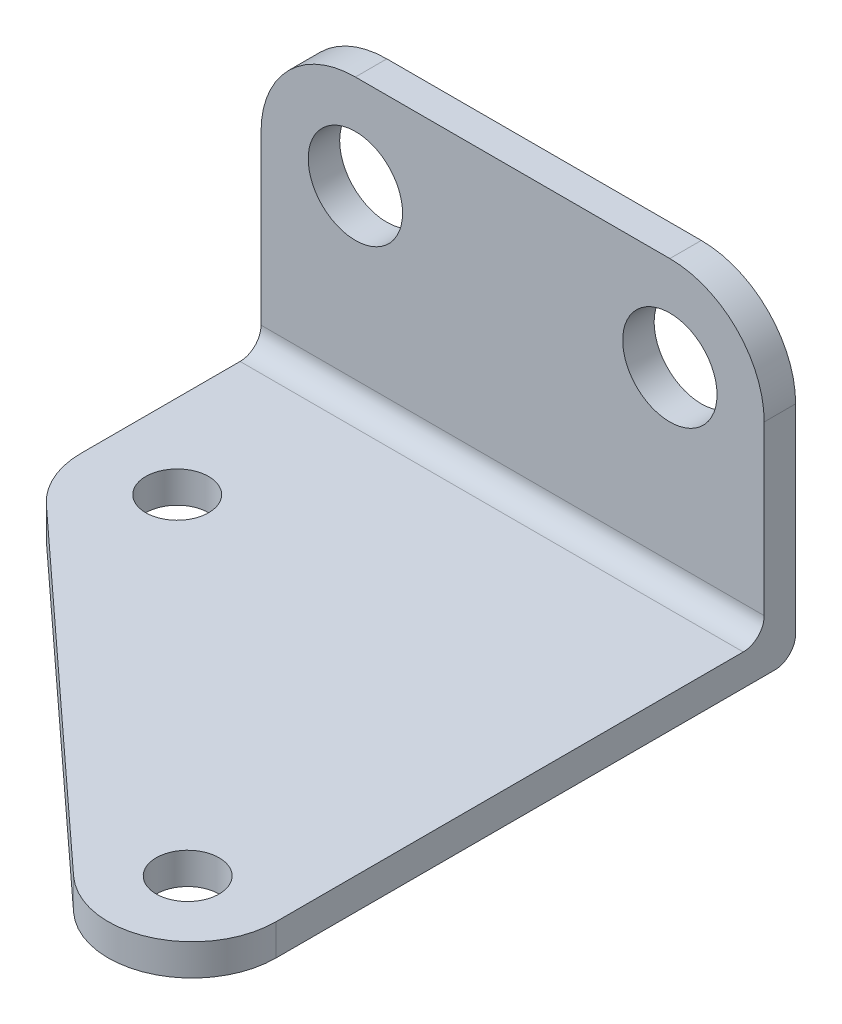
ISO-10303-21;
HEADER;
FILE_DESCRIPTION(('STEP AP214'),'2;1');
FILE_NAME('part.step','',(''),(''),'','','');
FILE_SCHEMA(('AUTOMOTIVE_DESIGN { 1 0 10303 214 1 1 1 1 }'));
ENDSEC;
DATA;
#1=APPLICATION_CONTEXT('core data for automotive mechanical design processes');
#2=APPLICATION_PROTOCOL_DEFINITION('international standard','automotive_design',2000,#1);
#3=PRODUCT_CONTEXT('',#1,'mechanical');
#4=PRODUCT('Part','Part','',(#3));
#5=PRODUCT_RELATED_PRODUCT_CATEGORY('part','',(#4));
#6=PRODUCT_DEFINITION_FORMATION('','',#4);
#7=PRODUCT_DEFINITION_CONTEXT('part definition',#1,'design');
#8=PRODUCT_DEFINITION('design','',#6,#7);
#9=PRODUCT_DEFINITION_SHAPE('','',#8);
#10=(LENGTH_UNIT() NAMED_UNIT(*) SI_UNIT(.MILLI.,.METRE.));
#11=(NAMED_UNIT(*) PLANE_ANGLE_UNIT() SI_UNIT($,.RADIAN.));
#12=(NAMED_UNIT(*) SI_UNIT($,.STERADIAN.) SOLID_ANGLE_UNIT());
#13=UNCERTAINTY_MEASURE_WITH_UNIT(LENGTH_MEASURE(1.E-05),#10,'distance_accuracy_value','');
#14=(GEOMETRIC_REPRESENTATION_CONTEXT(3) GLOBAL_UNCERTAINTY_ASSIGNED_CONTEXT((#13)) GLOBAL_UNIT_ASSIGNED_CONTEXT((#10,
#11,#12)) REPRESENTATION_CONTEXT('',''));
#15=CARTESIAN_POINT('',(0.,0.,0.));
#16=DIRECTION('',(0.,0.,1.));
#17=DIRECTION('',(1.,0.,0.));
#18=AXIS2_PLACEMENT_3D('',#15,#16,#17);
#19=CARTESIAN_POINT('',(0.,6.,0.));
#20=DIRECTION('',(0.,-1.,0.));
#21=DIRECTION('',(-1.,0.,0.));
#22=AXIS2_PLACEMENT_3D('',#19,#20,#21);
#23=PLANE('',#22);
#24=CARTESIAN_POINT('',(-40.,5.99999999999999,19.));
#25=DIRECTION('',(0.,1.,0.));
#26=DIRECTION('',(-1.,0.,0.));
#27=AXIS2_PLACEMENT_3D('',#24,#25,#26);
#28=CIRCLE('',#27,3.);
#29=CARTESIAN_POINT('',(-43.,5.99999999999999,19.));
#30=VERTEX_POINT('',#29);
#31=EDGE_CURVE('E219',#30,#30,#28,.T.);
#32=ORIENTED_EDGE('',*,*,#31,.F.);
#33=EDGE_LOOP('',(#32));
#34=FACE_BOUND('',#33,.T.);
#35=CARTESIAN_POINT('',(-8.,6.,50.));
#36=DIRECTION('',(0.,1.,0.));
#37=DIRECTION('',(-1.,0.,0.));
#38=AXIS2_PLACEMENT_3D('',#35,#36,#37);
#39=CIRCLE('',#38,3.);
#40=CARTESIAN_POINT('',(-11.,6.,50.));
#41=VERTEX_POINT('',#40);
#42=EDGE_CURVE('E210',#41,#41,#39,.T.);
#43=ORIENTED_EDGE('',*,*,#42,.F.);
#44=EDGE_LOOP('',(#43));
#45=FACE_BOUND('',#44,.T.);
#46=DIRECTION('',(0.,0.,-1.));
#47=VECTOR('',#46,1.);
#48=CARTESIAN_POINT('',(0.,6.,0.));
#49=LINE('',#48,#47);
#50=CARTESIAN_POINT('',(0.,6.,49.5770311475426));
#51=VERTEX_POINT('',#50);
#52=CARTESIAN_POINT('',(0.,6.,5.));
#53=VERTEX_POINT('',#52);
#54=EDGE_CURVE('E222',#51,#53,#49,.T.);
#55=ORIENTED_EDGE('',*,*,#54,.T.);
#56=DIRECTION('',(1.,0.,0.));
#57=VECTOR('',#56,1.);
#58=CARTESIAN_POINT('',(-48.,5.99999999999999,5.00000000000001));
#59=LINE('',#58,#57);
#60=CARTESIAN_POINT('',(-48.,5.99999999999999,5.00000000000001));
#61=VERTEX_POINT('',#60);
#62=EDGE_CURVE('E54',#53,#61,#59,.F.);
#63=ORIENTED_EDGE('',*,*,#62,.T.);
#64=DIRECTION('',(0.,0.,1.));
#65=VECTOR('',#64,1.);
#66=CARTESIAN_POINT('',(-48.,5.99999999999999,0.));
#67=LINE('',#66,#65);
#68=CARTESIAN_POINT('',(-48.,5.99999999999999,20.1779621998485));
#69=VERTEX_POINT('',#68);
#70=EDGE_CURVE('E223',#61,#69,#67,.T.);
#71=ORIENTED_EDGE('',*,*,#70,.T.);
#72=CARTESIAN_POINT('',(-40.,5.99999999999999,20.1779621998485));
#73=DIRECTION('',(0.,-1.,0.));
#74=DIRECTION('',(1.,0.,0.));
#75=AXIS2_PLACEMENT_3D('',#72,#73,#74);
#76=CIRCLE('',#75,8.);
#77=CARTESIAN_POINT('',(-45.4123698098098,5.99999999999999,26.0691635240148));
#78=VERTEX_POINT('',#77);
#79=EDGE_CURVE('E178',#69,#78,#76,.F.);
#80=ORIENTED_EDGE('',*,*,#79,.T.);
#81=DIRECTION('',(0.736400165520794,0.,0.676546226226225));
#82=VECTOR('',#81,1.);
#83=CARTESIAN_POINT('',(-48.,5.99999999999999,23.6918535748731));
#84=LINE('',#83,#82);
#85=CARTESIAN_POINT('',(-13.4123698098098,6.,55.468232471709));
#86=VERTEX_POINT('',#85);
#87=EDGE_CURVE('E228',#78,#86,#84,.T.);
#88=ORIENTED_EDGE('',*,*,#87,.T.);
#89=CARTESIAN_POINT('',(-8.,6.,49.5770311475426));
#90=DIRECTION('',(0.,-1.,0.));
#91=DIRECTION('',(1.,0.,0.));
#92=AXIS2_PLACEMENT_3D('',#89,#90,#91);
#93=CIRCLE('',#92,8.);
#94=EDGE_CURVE('E148',#86,#51,#93,.F.);
#95=ORIENTED_EDGE('',*,*,#94,.T.);
#96=EDGE_LOOP('',(#55,#63,#71,#80,#88,#95));
#97=FACE_BOUND('',#96,.T.);
#98=ADVANCED_FACE('F33',(#34,#45,#97),#23,.F.);
#99=CARTESIAN_POINT('',(0.,0.,3.));
#100=DIRECTION('',(-1.,0.,0.));
#101=DIRECTION('',(0.,-1.,0.));
#102=AXIS2_PLACEMENT_3D('',#99,#100,#101);
#103=PLANE('',#102);
#104=DIRECTION('',(0.,0.,-1.));
#105=VECTOR('',#104,1.);
#106=CARTESIAN_POINT('',(0.,3.,0.));
#107=LINE('',#106,#105);
#108=CARTESIAN_POINT('',(0.,3.,49.5770311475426));
#109=VERTEX_POINT('',#108);
#110=CARTESIAN_POINT('',(0.,3.,2.));
#111=VERTEX_POINT('',#110);
#112=EDGE_CURVE('E133',#109,#111,#107,.T.);
#113=ORIENTED_EDGE('',*,*,#112,.T.);
#114=CARTESIAN_POINT('',(0.,5.,2.));
#115=DIRECTION('',(-1.,0.,0.));
#116=DIRECTION('',(0.,-1.,0.));
#117=AXIS2_PLACEMENT_3D('',#114,#115,#116);
#118=CIRCLE('',#117,2.);
#119=CARTESIAN_POINT('',(0.,5.,0.));
#120=VERTEX_POINT('',#119);
#121=EDGE_CURVE('E190',#111,#120,#118,.F.);
#122=ORIENTED_EDGE('',*,*,#121,.T.);
#123=DIRECTION('',(0.,1.,0.));
#124=VECTOR('',#123,1.);
#125=CARTESIAN_POINT('',(0.,3.,0.));
#126=LINE('',#125,#124);
#127=CARTESIAN_POINT('',(0.,24.,0.));
#128=VERTEX_POINT('',#127);
#129=EDGE_CURVE('E144',#120,#128,#126,.T.);
#130=ORIENTED_EDGE('',*,*,#129,.T.);
#131=DIRECTION('',(0.,0.,-1.));
#132=VECTOR('',#131,1.);
#133=CARTESIAN_POINT('',(0.,24.,3.));
#134=LINE('',#133,#132);
#135=CARTESIAN_POINT('',(0.,24.,3.));
#136=VERTEX_POINT('',#135);
#137=EDGE_CURVE('E166',#128,#136,#134,.F.);
#138=ORIENTED_EDGE('',*,*,#137,.T.);
#139=DIRECTION('',(0.,-1.,0.));
#140=VECTOR('',#139,1.);
#141=CARTESIAN_POINT('',(0.,33.,3.));
#142=LINE('',#141,#140);
#143=CARTESIAN_POINT('',(0.,8.,3.));
#144=VERTEX_POINT('',#143);
#145=EDGE_CURVE('E200',#136,#144,#142,.T.);
#146=ORIENTED_EDGE('',*,*,#145,.T.);
#147=CARTESIAN_POINT('',(0.,8.,5.));
#148=DIRECTION('',(-1.,0.,0.));
#149=DIRECTION('',(0.,-1.,0.));
#150=AXIS2_PLACEMENT_3D('',#147,#148,#149);
#151=CIRCLE('',#150,2.);
#152=EDGE_CURVE('E41',#144,#53,#151,.T.);
#153=ORIENTED_EDGE('',*,*,#152,.T.);
#154=ORIENTED_EDGE('',*,*,#54,.F.);
#155=DIRECTION('',(0.,1.,0.));
#156=VECTOR('',#155,1.);
#157=CARTESIAN_POINT('',(0.,0.,49.5770311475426));
#158=LINE('',#157,#156);
#159=EDGE_CURVE('E150',#51,#109,#158,.F.);
#160=ORIENTED_EDGE('',*,*,#159,.T.);
#161=EDGE_LOOP('',(#113,#122,#130,#138,#146,#153,#154,#160));
#162=FACE_BOUND('',#161,.T.);
#163=ADVANCED_FACE('F206',(#162),#103,.F.);
#164=CARTESIAN_POINT('',(-48.,0.,3.));
#165=DIRECTION('',(1.,0.,0.));
#166=DIRECTION('',(0.,0.,-1.));
#167=AXIS2_PLACEMENT_3D('',#164,#165,#166);
#168=PLANE('',#167);
#169=DIRECTION('',(0.,1.,0.));
#170=VECTOR('',#169,1.);
#171=CARTESIAN_POINT('',(-48.,2.99999999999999,0.));
#172=LINE('',#171,#170);
#173=CARTESIAN_POINT('',(-48.,4.99999999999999,0.));
#174=VERTEX_POINT('',#173);
#175=CARTESIAN_POINT('',(-48.,24.,0.));
#176=VERTEX_POINT('',#175);
#177=EDGE_CURVE('E226',#174,#176,#172,.T.);
#178=ORIENTED_EDGE('',*,*,#177,.F.);
#179=CARTESIAN_POINT('',(-48.,4.99999999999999,2.00000000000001));
#180=DIRECTION('',(1.,0.,0.));
#181=DIRECTION('',(0.,0.,-1.));
#182=AXIS2_PLACEMENT_3D('',#179,#180,#181);
#183=CIRCLE('',#182,2.);
#184=CARTESIAN_POINT('',(-48.,2.99999999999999,2.00000000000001));
#185=VERTEX_POINT('',#184);
#186=EDGE_CURVE('E186',#174,#185,#183,.F.);
#187=ORIENTED_EDGE('',*,*,#186,.T.);
#188=DIRECTION('',(0.,0.,1.));
#189=VECTOR('',#188,1.);
#190=CARTESIAN_POINT('',(-48.,2.99999999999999,0.));
#191=LINE('',#190,#189);
#192=CARTESIAN_POINT('',(-48.,2.99999999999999,20.1779621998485));
#193=VERTEX_POINT('',#192);
#194=EDGE_CURVE('E132',#185,#193,#191,.T.);
#195=ORIENTED_EDGE('',*,*,#194,.T.);
#196=DIRECTION('',(0.,1.,0.));
#197=VECTOR('',#196,1.);
#198=CARTESIAN_POINT('',(-48.,0.,20.1779621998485));
#199=LINE('',#198,#197);
#200=EDGE_CURVE('E175',#193,#69,#199,.T.);
#201=ORIENTED_EDGE('',*,*,#200,.T.);
#202=ORIENTED_EDGE('',*,*,#70,.F.);
#203=CARTESIAN_POINT('',(-48.,7.99999999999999,5.00000000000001));
#204=DIRECTION('',(1.,0.,0.));
#205=DIRECTION('',(0.,0.,-1.));
#206=AXIS2_PLACEMENT_3D('',#203,#204,#205);
#207=CIRCLE('',#206,2.);
#208=CARTESIAN_POINT('',(-48.,7.99999999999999,3.00000000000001));
#209=VERTEX_POINT('',#208);
#210=EDGE_CURVE('E11',#61,#209,#207,.T.);
#211=ORIENTED_EDGE('',*,*,#210,.T.);
#212=DIRECTION('',(0.,-1.,0.));
#213=VECTOR('',#212,1.);
#214=CARTESIAN_POINT('',(-48.,33.,3.00000000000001));
#215=LINE('',#214,#213);
#216=CARTESIAN_POINT('',(-48.,24.,3.00000000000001));
#217=VERTEX_POINT('',#216);
#218=EDGE_CURVE('E203',#217,#209,#215,.T.);
#219=ORIENTED_EDGE('',*,*,#218,.F.);
#220=DIRECTION('',(0.,0.,1.));
#221=VECTOR('',#220,1.);
#222=CARTESIAN_POINT('',(-48.,24.,3.));
#223=LINE('',#222,#221);
#224=EDGE_CURVE('E172',#217,#176,#223,.F.);
#225=ORIENTED_EDGE('',*,*,#224,.T.);
#226=EDGE_LOOP('',(#178,#187,#195,#201,#202,#211,#219,#225));
#227=FACE_BOUND('',#226,.T.);
#228=ADVANCED_FACE('F251',(#227),#168,.F.);
#229=CARTESIAN_POINT('',(-48.,2.99999999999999,23.6918535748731));
#230=DIRECTION('',(0.676546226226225,0.,-0.736400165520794));
#231=DIRECTION('',(-0.736400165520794,0.,-0.676546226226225));
#232=AXIS2_PLACEMENT_3D('',#229,#230,#231);
#233=PLANE('',#232);
#234=ORIENTED_EDGE('',*,*,#87,.F.);
#235=DIRECTION('',(0.,1.,0.));
#236=VECTOR('',#235,1.);
#237=CARTESIAN_POINT('',(-45.4123698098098,2.99999999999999,26.0691635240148));
#238=LINE('',#237,#236);
#239=CARTESIAN_POINT('',(-45.4123698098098,2.99999999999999,26.0691635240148));
#240=VERTEX_POINT('',#239);
#241=EDGE_CURVE('E128',#78,#240,#238,.F.);
#242=ORIENTED_EDGE('',*,*,#241,.T.);
#243=DIRECTION('',(0.736400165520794,0.,0.676546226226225));
#244=VECTOR('',#243,1.);
#245=CARTESIAN_POINT('',(-48.,2.99999999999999,23.6918535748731));
#246=LINE('',#245,#244);
#247=CARTESIAN_POINT('',(-13.4123698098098,3.,55.468232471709));
#248=VERTEX_POINT('',#247);
#249=EDGE_CURVE('E121',#240,#248,#246,.T.);
#250=ORIENTED_EDGE('',*,*,#249,.T.);
#251=DIRECTION('',(0.,1.,0.));
#252=VECTOR('',#251,1.);
#253=CARTESIAN_POINT('',(-13.4123698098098,3.,55.468232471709));
#254=LINE('',#253,#252);
#255=EDGE_CURVE('E126',#248,#86,#254,.T.);
#256=ORIENTED_EDGE('',*,*,#255,.T.);
#257=EDGE_LOOP('',(#234,#242,#250,#256));
#258=FACE_BOUND('',#257,.T.);
#259=ADVANCED_FACE('F124',(#258),#233,.F.);
#260=CARTESIAN_POINT('',(-40.,3.,19.));
#261=DIRECTION('',(0.,-1.,0.));
#262=DIRECTION('',(1.,0.,0.));
#263=AXIS2_PLACEMENT_3D('',#260,#261,#262);
#264=CYLINDRICAL_SURFACE('',#263,3.);
#265=CARTESIAN_POINT('',(-40.,3.,19.));
#266=DIRECTION('',(0.,1.,0.));
#267=DIRECTION('',(-1.,0.,0.));
#268=AXIS2_PLACEMENT_3D('',#265,#266,#267);
#269=CIRCLE('',#268,3.);
#270=CARTESIAN_POINT('',(-43.,2.99999999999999,19.));
#271=VERTEX_POINT('',#270);
#272=EDGE_CURVE('E466',#271,#271,#269,.T.);
#273=ORIENTED_EDGE('',*,*,#272,.F.);
#274=EDGE_LOOP('',(#273));
#275=FACE_BOUND('',#274,.T.);
#276=ORIENTED_EDGE('',*,*,#31,.T.);
#277=EDGE_LOOP('',(#276));
#278=FACE_BOUND('',#277,.T.);
#279=ADVANCED_FACE('F282',(#275,#278),#264,.F.);
#280=CARTESIAN_POINT('',(-8.,3.,50.));
#281=DIRECTION('',(0.,-1.,0.));
#282=DIRECTION('',(1.,0.,0.));
#283=AXIS2_PLACEMENT_3D('',#280,#281,#282);
#284=CYLINDRICAL_SURFACE('',#283,3.);
#285=CARTESIAN_POINT('',(-8.,3.,50.));
#286=DIRECTION('',(0.,1.,0.));
#287=DIRECTION('',(-1.,0.,0.));
#288=AXIS2_PLACEMENT_3D('',#285,#286,#287);
#289=CIRCLE('',#288,3.);
#290=CARTESIAN_POINT('',(-11.,3.,50.));
#291=VERTEX_POINT('',#290);
#292=EDGE_CURVE('E463',#291,#291,#289,.T.);
#293=ORIENTED_EDGE('',*,*,#292,.F.);
#294=EDGE_LOOP('',(#293));
#295=FACE_BOUND('',#294,.T.);
#296=ORIENTED_EDGE('',*,*,#42,.T.);
#297=EDGE_LOOP('',(#296));
#298=FACE_BOUND('',#297,.T.);
#299=ADVANCED_FACE('F279',(#295,#298),#284,.F.);
#300=CARTESIAN_POINT('',(0.,3.,0.));
#301=DIRECTION('',(0.,-1.,0.));
#302=DIRECTION('',(-1.,0.,0.));
#303=AXIS2_PLACEMENT_3D('',#300,#301,#302);
#304=PLANE('',#303);
#305=ORIENTED_EDGE('',*,*,#194,.F.);
#306=DIRECTION('',(-1.,0.,0.));
#307=VECTOR('',#306,1.);
#308=CARTESIAN_POINT('',(0.,3.,2.));
#309=LINE('',#308,#307);
#310=EDGE_CURVE('E188',#185,#111,#309,.F.);
#311=ORIENTED_EDGE('',*,*,#310,.T.);
#312=ORIENTED_EDGE('',*,*,#112,.F.);
#313=CARTESIAN_POINT('',(-8.,3.,49.5770311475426));
#314=DIRECTION('',(0.,1.,0.));
#315=DIRECTION('',(-1.,0.,0.));
#316=AXIS2_PLACEMENT_3D('',#313,#314,#315);
#317=CIRCLE('',#316,8.);
#318=EDGE_CURVE('E136',#248,#109,#317,.T.);
#319=ORIENTED_EDGE('',*,*,#318,.F.);
#320=ORIENTED_EDGE('',*,*,#249,.F.);
#321=CARTESIAN_POINT('',(-40.,3.,20.1779621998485));
#322=DIRECTION('',(0.,-1.,0.));
#323=DIRECTION('',(1.,0.,0.));
#324=AXIS2_PLACEMENT_3D('',#321,#322,#323);
#325=CIRCLE('',#324,8.);
#326=EDGE_CURVE('E181',#240,#193,#325,.T.);
#327=ORIENTED_EDGE('',*,*,#326,.T.);
#328=EDGE_LOOP('',(#305,#311,#312,#319,#320,#327));
#329=FACE_BOUND('',#328,.T.);
#330=ORIENTED_EDGE('',*,*,#272,.T.);
#331=EDGE_LOOP('',(#330));
#332=FACE_BOUND('',#331,.T.);
#333=ORIENTED_EDGE('',*,*,#292,.T.);
#334=EDGE_LOOP('',(#333));
#335=FACE_BOUND('',#334,.T.);
#336=ADVANCED_FACE('F138',(#329,#332,#335),#304,.T.);
#337=CARTESIAN_POINT('',(0.,3.,0.));
#338=DIRECTION('',(0.,0.,-1.));
#339=DIRECTION('',(-1.,0.,0.));
#340=AXIS2_PLACEMENT_3D('',#337,#338,#339);
#341=PLANE('',#340);
#342=CARTESIAN_POINT('',(-9.,24.,0.));
#343=DIRECTION('',(0.,0.,-1.));
#344=DIRECTION('',(-1.,0.,0.));
#345=AXIS2_PLACEMENT_3D('',#342,#343,#344);
#346=CIRCLE('',#345,4.5);
#347=CARTESIAN_POINT('',(-13.5,24.,0.));
#348=VERTEX_POINT('',#347);
#349=EDGE_CURVE('E450',#348,#348,#346,.T.);
#350=ORIENTED_EDGE('',*,*,#349,.F.);
#351=EDGE_LOOP('',(#350));
#352=FACE_BOUND('',#351,.T.);
#353=CARTESIAN_POINT('',(-39.,24.,0.));
#354=DIRECTION('',(0.,0.,-1.));
#355=DIRECTION('',(-1.,0.,0.));
#356=AXIS2_PLACEMENT_3D('',#353,#354,#355);
#357=CIRCLE('',#356,4.5);
#358=CARTESIAN_POINT('',(-43.5,24.,0.));
#359=VERTEX_POINT('',#358);
#360=EDGE_CURVE('E460',#359,#359,#357,.T.);
#361=ORIENTED_EDGE('',*,*,#360,.F.);
#362=EDGE_LOOP('',(#361));
#363=FACE_BOUND('',#362,.T.);
#364=ORIENTED_EDGE('',*,*,#129,.F.);
#365=DIRECTION('',(-1.,0.,0.));
#366=VECTOR('',#365,1.);
#367=CARTESIAN_POINT('',(0.,5.,0.));
#368=LINE('',#367,#366);
#369=EDGE_CURVE('E183',#120,#174,#368,.T.);
#370=ORIENTED_EDGE('',*,*,#369,.T.);
#371=ORIENTED_EDGE('',*,*,#177,.T.);
#372=CARTESIAN_POINT('',(-39.,24.,0.));
#373=DIRECTION('',(0.,0.,-1.));
#374=DIRECTION('',(-1.,0.,0.));
#375=AXIS2_PLACEMENT_3D('',#372,#373,#374);
#376=CIRCLE('',#375,9.);
#377=CARTESIAN_POINT('',(-39.,33.,0.));
#378=VERTEX_POINT('',#377);
#379=EDGE_CURVE('E161',#176,#378,#376,.T.);
#380=ORIENTED_EDGE('',*,*,#379,.T.);
#381=DIRECTION('',(-1.,0.,0.));
#382=VECTOR('',#381,1.);
#383=CARTESIAN_POINT('',(0.,33.,0.));
#384=LINE('',#383,#382);
#385=CARTESIAN_POINT('',(-9.00000000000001,33.,0.));
#386=VERTEX_POINT('',#385);
#387=EDGE_CURVE('E213',#386,#378,#384,.T.);
#388=ORIENTED_EDGE('',*,*,#387,.F.);
#389=CARTESIAN_POINT('',(-9.,24.,0.));
#390=DIRECTION('',(0.,0.,-1.));
#391=DIRECTION('',(-1.,0.,0.));
#392=AXIS2_PLACEMENT_3D('',#389,#390,#391);
#393=CIRCLE('',#392,9.);
#394=EDGE_CURVE('E163',#386,#128,#393,.T.);
#395=ORIENTED_EDGE('',*,*,#394,.T.);
#396=EDGE_LOOP('',(#364,#370,#371,#380,#388,#395));
#397=FACE_BOUND('',#396,.T.);
#398=ADVANCED_FACE('F236',(#352,#363,#397),#341,.T.);
#399=CARTESIAN_POINT('',(-8.,3.,49.5770311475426));
#400=DIRECTION('',(0.,1.,0.));
#401=DIRECTION('',(-1.,0.,0.));
#402=AXIS2_PLACEMENT_3D('',#399,#400,#401);
#403=CYLINDRICAL_SURFACE('',#402,8.);
#404=ORIENTED_EDGE('',*,*,#318,.T.);
#405=ORIENTED_EDGE('',*,*,#159,.F.);
#406=ORIENTED_EDGE('',*,*,#94,.F.);
#407=ORIENTED_EDGE('',*,*,#255,.F.);
#408=EDGE_LOOP('',(#404,#405,#406,#407));
#409=FACE_BOUND('',#408,.T.);
#410=ADVANCED_FACE('F147',(#409),#403,.T.);
#411=CARTESIAN_POINT('',(0.,33.,3.));
#412=DIRECTION('',(0.,0.,-1.));
#413=DIRECTION('',(-1.,0.,0.));
#414=AXIS2_PLACEMENT_3D('',#411,#412,#413);
#415=PLANE('',#414);
#416=CARTESIAN_POINT('',(-9.,24.,3.));
#417=DIRECTION('',(0.,0.,1.));
#418=DIRECTION('',(1.,0.,0.));
#419=AXIS2_PLACEMENT_3D('',#416,#417,#418);
#420=CIRCLE('',#419,4.5);
#421=CARTESIAN_POINT('',(-4.5,24.,3.));
#422=VERTEX_POINT('',#421);
#423=EDGE_CURVE('E453',#422,#422,#420,.T.);
#424=ORIENTED_EDGE('',*,*,#423,.F.);
#425=EDGE_LOOP('',(#424));
#426=FACE_BOUND('',#425,.T.);
#427=CARTESIAN_POINT('',(-39.,24.,3.));
#428=DIRECTION('',(0.,0.,1.));
#429=DIRECTION('',(1.,0.,0.));
#430=AXIS2_PLACEMENT_3D('',#427,#428,#429);
#431=CIRCLE('',#430,4.5);
#432=CARTESIAN_POINT('',(-34.5,24.,3.));
#433=VERTEX_POINT('',#432);
#434=EDGE_CURVE('E455',#433,#433,#431,.T.);
#435=ORIENTED_EDGE('',*,*,#434,.F.);
#436=EDGE_LOOP('',(#435));
#437=FACE_BOUND('',#436,.T.);
#438=ORIENTED_EDGE('',*,*,#218,.T.);
#439=DIRECTION('',(1.,0.,0.));
#440=VECTOR('',#439,1.);
#441=CARTESIAN_POINT('',(0.,8.,3.));
#442=LINE('',#441,#440);
#443=EDGE_CURVE('E192',#209,#144,#442,.T.);
#444=ORIENTED_EDGE('',*,*,#443,.T.);
#445=ORIENTED_EDGE('',*,*,#145,.F.);
#446=CARTESIAN_POINT('',(-9.,24.,3.));
#447=DIRECTION('',(0.,0.,-1.));
#448=DIRECTION('',(-1.,0.,0.));
#449=AXIS2_PLACEMENT_3D('',#446,#447,#448);
#450=CIRCLE('',#449,9.);
#451=CARTESIAN_POINT('',(-9.00000000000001,33.,3.));
#452=VERTEX_POINT('',#451);
#453=EDGE_CURVE('E170',#136,#452,#450,.F.);
#454=ORIENTED_EDGE('',*,*,#453,.T.);
#455=DIRECTION('',(1.,0.,0.));
#456=VECTOR('',#455,1.);
#457=CARTESIAN_POINT('',(0.,33.,3.));
#458=LINE('',#457,#456);
#459=CARTESIAN_POINT('',(-39.,33.,3.));
#460=VERTEX_POINT('',#459);
#461=EDGE_CURVE('E208',#460,#452,#458,.T.);
#462=ORIENTED_EDGE('',*,*,#461,.F.);
#463=CARTESIAN_POINT('',(-39.,24.,3.));
#464=DIRECTION('',(0.,0.,-1.));
#465=DIRECTION('',(-1.,0.,0.));
#466=AXIS2_PLACEMENT_3D('',#463,#464,#465);
#467=CIRCLE('',#466,9.);
#468=EDGE_CURVE('E168',#460,#217,#467,.F.);
#469=ORIENTED_EDGE('',*,*,#468,.T.);
#470=EDGE_LOOP('',(#438,#444,#445,#454,#462,#469));
#471=FACE_BOUND('',#470,.T.);
#472=ADVANCED_FACE('F199',(#426,#437,#471),#415,.F.);
#473=CARTESIAN_POINT('',(0.,33.,0.));
#474=DIRECTION('',(0.,-1.,0.));
#475=DIRECTION('',(1.,0.,0.));
#476=AXIS2_PLACEMENT_3D('',#473,#474,#475);
#477=PLANE('',#476);
#478=ORIENTED_EDGE('',*,*,#461,.T.);
#479=DIRECTION('',(0.,0.,-1.));
#480=VECTOR('',#479,1.);
#481=CARTESIAN_POINT('',(-9.00000000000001,33.,0.));
#482=LINE('',#481,#480);
#483=EDGE_CURVE('E158',#452,#386,#482,.T.);
#484=ORIENTED_EDGE('',*,*,#483,.T.);
#485=ORIENTED_EDGE('',*,*,#387,.T.);
#486=DIRECTION('',(0.,0.,1.));
#487=VECTOR('',#486,1.);
#488=CARTESIAN_POINT('',(-39.,33.,0.));
#489=LINE('',#488,#487);
#490=EDGE_CURVE('E155',#378,#460,#489,.T.);
#491=ORIENTED_EDGE('',*,*,#490,.T.);
#492=EDGE_LOOP('',(#478,#484,#485,#491));
#493=FACE_BOUND('',#492,.T.);
#494=ADVANCED_FACE('F243',(#493),#477,.F.);
#495=CARTESIAN_POINT('',(-9.,24.,0.));
#496=DIRECTION('',(0.,0.,-1.));
#497=DIRECTION('',(0.,1.,0.));
#498=AXIS2_PLACEMENT_3D('',#495,#496,#497);
#499=CYLINDRICAL_SURFACE('',#498,9.);
#500=ORIENTED_EDGE('',*,*,#453,.F.);
#501=ORIENTED_EDGE('',*,*,#137,.F.);
#502=ORIENTED_EDGE('',*,*,#394,.F.);
#503=ORIENTED_EDGE('',*,*,#483,.F.);
#504=EDGE_LOOP('',(#500,#501,#502,#503));
#505=FACE_BOUND('',#504,.T.);
#506=ADVANCED_FACE('F240',(#505),#499,.T.);
#507=CARTESIAN_POINT('',(-39.,24.,0.));
#508=DIRECTION('',(0.,0.,1.));
#509=DIRECTION('',(0.,-1.,0.));
#510=AXIS2_PLACEMENT_3D('',#507,#508,#509);
#511=CYLINDRICAL_SURFACE('',#510,9.);
#512=ORIENTED_EDGE('',*,*,#379,.F.);
#513=ORIENTED_EDGE('',*,*,#224,.F.);
#514=ORIENTED_EDGE('',*,*,#468,.F.);
#515=ORIENTED_EDGE('',*,*,#490,.F.);
#516=EDGE_LOOP('',(#512,#513,#514,#515));
#517=FACE_BOUND('',#516,.T.);
#518=ADVANCED_FACE('F247',(#517),#511,.T.);
#519=CARTESIAN_POINT('',(-40.,0.,20.1779621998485));
#520=DIRECTION('',(0.,1.,0.));
#521=DIRECTION('',(0.,0.,1.));
#522=AXIS2_PLACEMENT_3D('',#519,#520,#521);
#523=CYLINDRICAL_SURFACE('',#522,8.);
#524=ORIENTED_EDGE('',*,*,#326,.F.);
#525=ORIENTED_EDGE('',*,*,#241,.F.);
#526=ORIENTED_EDGE('',*,*,#79,.F.);
#527=ORIENTED_EDGE('',*,*,#200,.F.);
#528=EDGE_LOOP('',(#524,#525,#526,#527));
#529=FACE_BOUND('',#528,.T.);
#530=ADVANCED_FACE('F262',(#529),#523,.T.);
#531=CARTESIAN_POINT('',(0.,5.,2.));
#532=DIRECTION('',(-1.,0.,0.));
#533=DIRECTION('',(0.,0.,1.));
#534=AXIS2_PLACEMENT_3D('',#531,#532,#533);
#535=CYLINDRICAL_SURFACE('',#534,2.);
#536=ORIENTED_EDGE('',*,*,#121,.F.);
#537=ORIENTED_EDGE('',*,*,#310,.F.);
#538=ORIENTED_EDGE('',*,*,#186,.F.);
#539=ORIENTED_EDGE('',*,*,#369,.F.);
#540=EDGE_LOOP('',(#536,#537,#538,#539));
#541=FACE_BOUND('',#540,.T.);
#542=ADVANCED_FACE('F254',(#541),#535,.T.);
#543=CARTESIAN_POINT('',(0.,8.,5.));
#544=DIRECTION('',(-1.,0.,0.));
#545=DIRECTION('',(0.,0.,1.));
#546=AXIS2_PLACEMENT_3D('',#543,#544,#545);
#547=CYLINDRICAL_SURFACE('',#546,2.);
#548=ORIENTED_EDGE('',*,*,#210,.F.);
#549=ORIENTED_EDGE('',*,*,#62,.F.);
#550=ORIENTED_EDGE('',*,*,#152,.F.);
#551=ORIENTED_EDGE('',*,*,#443,.F.);
#552=EDGE_LOOP('',(#548,#549,#550,#551));
#553=FACE_BOUND('',#552,.T.);
#554=ADVANCED_FACE('F35',(#553),#547,.F.);
#555=CARTESIAN_POINT('',(-39.,24.,-64.));
#556=DIRECTION('',(0.,0.,1.));
#557=DIRECTION('',(1.,0.,0.));
#558=AXIS2_PLACEMENT_3D('',#555,#556,#557);
#559=CYLINDRICAL_SURFACE('',#558,4.5);
#560=ORIENTED_EDGE('',*,*,#360,.T.);
#561=EDGE_LOOP('',(#560));
#562=FACE_BOUND('',#561,.T.);
#563=ORIENTED_EDGE('',*,*,#434,.T.);
#564=EDGE_LOOP('',(#563));
#565=FACE_BOUND('',#564,.T.);
#566=ADVANCED_FACE('F253',(#562,#565),#559,.F.);
#567=CARTESIAN_POINT('',(-9.,24.,-64.));
#568=DIRECTION('',(0.,0.,1.));
#569=DIRECTION('',(1.,0.,0.));
#570=AXIS2_PLACEMENT_3D('',#567,#568,#569);
#571=CYLINDRICAL_SURFACE('',#570,4.5);
#572=ORIENTED_EDGE('',*,*,#349,.T.);
#573=EDGE_LOOP('',(#572));
#574=FACE_BOUND('',#573,.T.);
#575=ORIENTED_EDGE('',*,*,#423,.T.);
#576=EDGE_LOOP('',(#575));
#577=FACE_BOUND('',#576,.T.);
#578=ADVANCED_FACE('F259',(#574,#577),#571,.F.);
#579=CLOSED_SHELL('',(#98,#163,#228,#259,#279,#299,#336,#398,#410,#472,#494,#506,#518,#530,#542,
#554,#566,#578));
#580=MANIFOLD_SOLID_BREP('B2',#579);
#581=ADVANCED_BREP_SHAPE_REPRESENTATION('',(#18,#580),#14);
#582=SHAPE_DEFINITION_REPRESENTATION(#9,#581);
ENDSEC;
END-ISO-10303-21;
